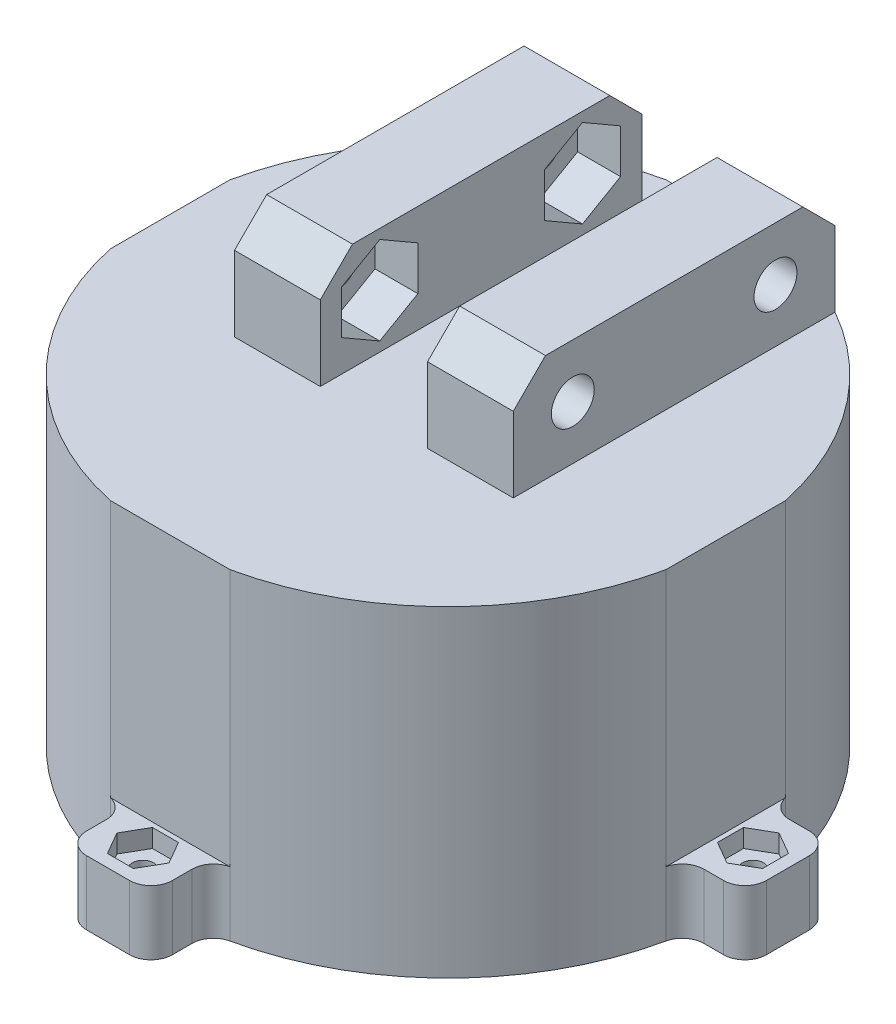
from build123d import *

# Parameters (mm, degrees)
SKETCH1_R                = 26.5
BOSS_EXTRUDE1_DEPTH      = 30
SKETCH3_W                = 8
SKETCH3_H                = 5.5
BOSS_EXTRUDE2_DEPTH      = 6
SKETCH4_R                = 1
CUT_EXTRUDE2_DEPTH       = 52.057909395
CUT_EXTRUDE3_DEPTH       = 1.7
FILLET1_R                = 2
SKETCH7_R                = 4.5
SKETCH7_W                = 6
SKETCH7_H                = 11
CUT_EXTRUDE4_DEPTH       = 10
CIRPATTERN2_COUNT        = 4
FILLET1_OF_CIRPATTERN2_R = 2
CIRPATTERN3_COUNT        = 2
SKETCH9_W                = 11.157894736
SKETCH9_H                = 1
CUT_EXTRUDE5_DEPTH       = 24
CIRPATTERN4_COUNT        = 4
SKETCH10_W               = 8
SKETCH10_H               = 30
BOSS_EXTRUDE3_DEPTH      = 10
CUT_EXTRUDE6_DEPTH       = 4
SKETCH13_R               = 2
CUT_EXTRUDE8_DEPTH       = 66.27522464
CHAMFER4_SIZE            = 3
CHAMFER4_OF_MIRROR1_SIZE = 3
BOSS_EXTRUDE4_START      = 10
SKETCH14_R               = 4.5
SKETCH14_W               = 6
SKETCH14_H               = 11
BOSS_EXTRUDE4_DEPTH      = 10


with BuildPart() as part:
    # Sketch1 → Boss-Extrude1 (new body)
    with BuildSketch(Plane(origin=(0, 0, 0), x_dir=(1, 0, 0), z_dir=(0, 1, 0))):
        with Locations(Location((0, 0, 0), (0, 0, 270))):
            Circle(SKETCH1_R)
    extrude(amount=BOSS_EXTRUDE1_DEPTH)

    # Sketch3 → Boss-Extrude2 (add)
    with BuildSketch(Plane.XZ):
        with Locations((0, 28.946373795)):
            Rectangle(SKETCH3_W, SKETCH3_H)
    boss_extrude2 = extrude(amount=-BOSS_EXTRUDE2_DEPTH)

    # Sketch4 → Cut-Extrude2 (cut, through all)
    with BuildSketch(Plane.XZ):
        with Locations(Location((0, 28.446373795, 0), (0, 0, 270))):
            Circle(SKETCH4_R)
    cut_extrude2 = extrude(amount=-CUT_EXTRUDE2_DEPTH, mode=Mode.SUBTRACT)

    # Sketch5 → Cut-Extrude3 (cut)
    with BuildSketch(Plane(origin=(0, 6, 0), x_dir=(1, 0, 0), z_dir=(0, 1, 0))):
        Polygon((1.212435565, -26.346373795), (-1.212435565, -26.346373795), (-2.424871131, -28.446373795), (-1.212435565, -30.546373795), (1.212435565, -30.546373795), (2.424871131, -28.446373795), align=None)
    cut_extrude3 = extrude(amount=-CUT_EXTRUDE3_DEPTH, mode=Mode.SUBTRACT)

    # Fillet1
    fillet1_edges = [part.edges().sort_by_distance(p)[0] for p in [
        (-4, 3, 26.196373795),
        (-4, 3, 31.696373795),
        (4, 3, 31.696373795),
        (4, 3, 26.196373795),
    ]]
    fillet(fillet1_edges, radius=FILLET1_R)

    # Sketch7 → Cut-Extrude4 (cut)
    with BuildSketch(Plane.XZ):
        with Locations(Location((-19, 0, 0), (0, 0, 270))):
            Circle(SKETCH7_R)
        with Locations((-15.566343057, -11.6)):
            Rectangle(SKETCH7_W, SKETCH7_H)
    cut_extrude4 = extrude(amount=-CUT_EXTRUDE4_DEPTH, mode=Mode.SUBTRACT)

    # CirPattern2: Boss-Extrude2, Cut-Extrude2, Cut-Extrude3 ×4 about axis
    cirpattern2_axis = Axis((0, 0, 0), (0, 1, 0))
    add([boss_extrude2.rotate(cirpattern2_axis, i * 360 / CIRPATTERN2_COUNT) for i in range(1, CIRPATTERN2_COUNT)])
    add([cut_extrude2.rotate(cirpattern2_axis, i * 360 / CIRPATTERN2_COUNT) for i in range(1, CIRPATTERN2_COUNT)], mode=Mode.SUBTRACT)
    add([cut_extrude3.rotate(cirpattern2_axis, i * 360 / CIRPATTERN2_COUNT) for i in range(1, CIRPATTERN2_COUNT)], mode=Mode.SUBTRACT)

    # Fillet1 of CirPattern2
    fillet1_of_cirpattern2_edges = [part.edges().sort_by_distance(p)[0] for p in [
        (26.196373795, 3, 4),
        (31.696373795, 3, 4),
        (31.696373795, 3, -4),
        (26.196373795, 3, -4),
        (4, 3, -26.196373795),
        (4, 3, -31.696373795),
        (-4, 3, -31.696373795),
        (-4, 3, -26.196373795),
        (-26.196373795, 3, -4),
        (-31.696373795, 3, -4),
        (-31.696373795, 3, 4),
        (-26.196373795, 3, 4),
    ]]
    fillet(fillet1_of_cirpattern2_edges, radius=FILLET1_OF_CIRPATTERN2_R)

    # CirPattern3: Cut-Extrude4 ×2 about axis
    cirpattern3_axis = Axis((0, 0, 0), (0, 1, 0))
    for i in range(1, CIRPATTERN3_COUNT):
        add(cut_extrude4.rotate(cirpattern3_axis, i * 360 / CIRPATTERN3_COUNT), mode=Mode.SUBTRACT)

    # Sketch9 → Cut-Extrude5 (cut)
    with BuildSketch(Plane(origin=(0, 30, 0), x_dir=(1, 0, 0), z_dir=(0, 1, 0))):
        with Locations((0, -26.40608705)):
            Rectangle(SKETCH9_W, SKETCH9_H)
    cut_extrude5 = extrude(amount=-CUT_EXTRUDE5_DEPTH, mode=Mode.SUBTRACT)

    # CirPattern4: Cut-Extrude5 ×4 about axis
    cirpattern4_axis = Axis((0, 0, 0), (0, 1, 0))
    for i in range(1, CIRPATTERN4_COUNT):
        add(cut_extrude5.rotate(cirpattern4_axis, i * 360 / CIRPATTERN4_COUNT), mode=Mode.SUBTRACT)

    # Sketch10 → Boss-Extrude3 (add)
    with BuildSketch(Plane(origin=(0, 30, 0), x_dir=(1, 0, 0), z_dir=(0, 1, 0))):
        with Locations((-9, 8.092206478)):
            Rectangle(SKETCH10_W, SKETCH10_H)
    boss_extrude3 = extrude(amount=BOSS_EXTRUDE3_DEPTH)

    # Sketch11 → Cut-Extrude6 (cut)
    with BuildSketch(Plane(origin=(-5, 0, 0), x_dir=(0, 0, -1), z_dir=(1, 0, 0))):
        Polygon((-1.357793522, 39.099186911), (-4.907793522, 37.049593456), (-4.907793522, 32.950406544), (-1.357793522, 30.900813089), (2.192206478, 32.950406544), (2.192206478, 37.049593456), align=None)
        Polygon((13.992206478, 37.049593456), (17.542206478, 39.099186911), (21.092206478, 37.049593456), (21.092206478, 32.950406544), (17.542206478, 30.900813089), (13.992206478, 32.950406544), align=None)
    cut_extrude6 = extrude(amount=-CUT_EXTRUDE6_DEPTH, mode=Mode.SUBTRACT)

    # Sketch13 → Cut-Extrude8 (cut, through all)
    with BuildSketch(Plane(origin=(-9, 0, 0), x_dir=(0, 0, -1), z_dir=(1, 0, 0))):
        with Locations((-1.357793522, 35)):
            Circle(SKETCH13_R)
        with Locations((17.542206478, 35)):
            Circle(SKETCH13_R)
    cut_extrude8 = extrude(amount=-CUT_EXTRUDE8_DEPTH, mode=Mode.SUBTRACT)

    # Chamfer4
    chamfer4_edges = [part.edges().sort_by_distance(p)[0] for p in [
        (-9, 40, 6.907793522),
        (-9, 40, -23.092206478),
    ]]
    chamfer(chamfer4_edges, length=CHAMFER4_SIZE)

    # Mirror1: Boss-Extrude3, Cut-Extrude6, Cut-Extrude8 across plane
    add(boss_extrude3.mirror(Plane(origin=(0, 0, 0), x_dir=(0, 0, 1), z_dir=(1, 0, 0))))
    add(cut_extrude6.mirror(Plane(origin=(0, 0, 0), x_dir=(0, 0, 1), z_dir=(1, 0, 0))), mode=Mode.SUBTRACT)
    add(cut_extrude8.mirror(Plane(origin=(0, 0, 0), x_dir=(0, 0, 1), z_dir=(1, 0, 0))), mode=Mode.SUBTRACT)

    # Chamfer4 of Mirror1
    chamfer4_of_mirror1_edges = [part.edges().sort_by_distance(p)[0] for p in [
        (9, 40, 6.907793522),
        (9, 40, -23.092206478),
    ]]
    chamfer(chamfer4_of_mirror1_edges, length=CHAMFER4_OF_MIRROR1_SIZE)

    # Sketch14 → Boss-Extrude4 (add)
    with BuildSketch(Plane.XZ.offset(-10).offset(BOSS_EXTRUDE4_START)):
        with Locations((-19, 0)):
            Circle(SKETCH14_R)
        with Locations((-15.566343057, -11.6)):
            Rectangle(SKETCH14_W, SKETCH14_H)
    extrude(amount=-BOSS_EXTRUDE4_DEPTH)


solid = part.part
